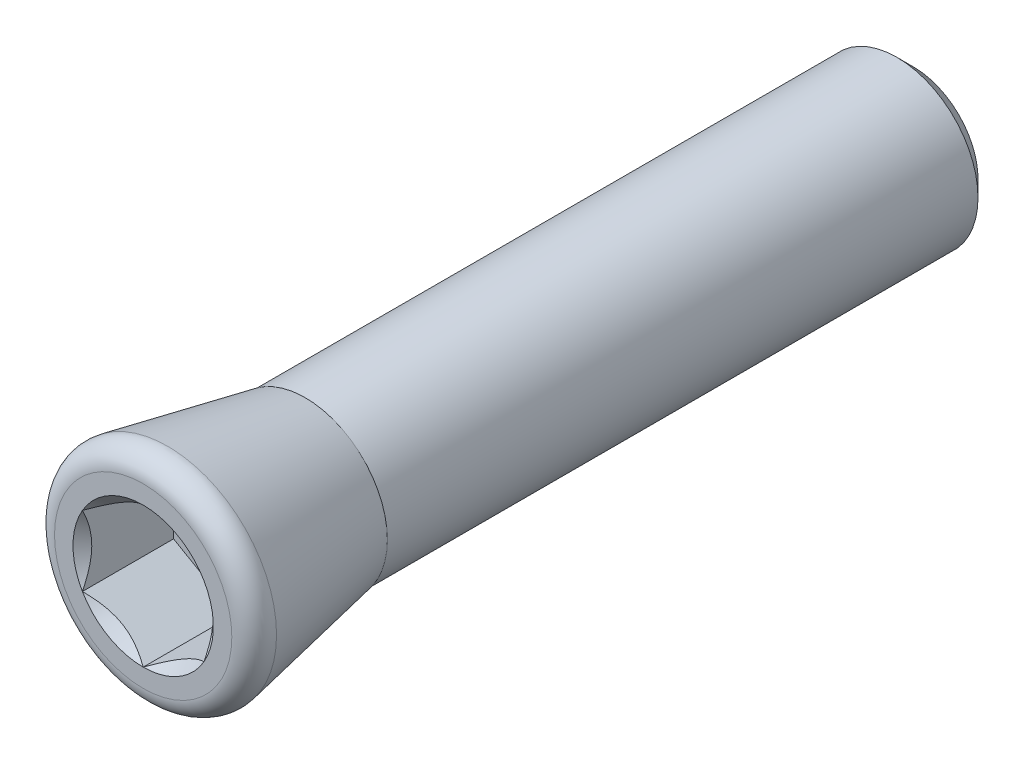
ISO-10303-21;
HEADER;
FILE_DESCRIPTION(('STEP AP214'),'2;1');
FILE_NAME('part.step','',(''),(''),'','','');
FILE_SCHEMA(('AUTOMOTIVE_DESIGN { 1 0 10303 214 1 1 1 1 }'));
ENDSEC;
DATA;
#1=APPLICATION_CONTEXT('core data for automotive mechanical design processes');
#2=APPLICATION_PROTOCOL_DEFINITION('international standard','automotive_design',2000,#1);
#3=PRODUCT_CONTEXT('',#1,'mechanical');
#4=PRODUCT('Part','Part','',(#3));
#5=PRODUCT_RELATED_PRODUCT_CATEGORY('part','',(#4));
#6=PRODUCT_DEFINITION_FORMATION('','',#4);
#7=PRODUCT_DEFINITION_CONTEXT('part definition',#1,'design');
#8=PRODUCT_DEFINITION('design','',#6,#7);
#9=PRODUCT_DEFINITION_SHAPE('','',#8);
#10=(LENGTH_UNIT() NAMED_UNIT(*) SI_UNIT(.MILLI.,.METRE.));
#11=(NAMED_UNIT(*) PLANE_ANGLE_UNIT() SI_UNIT($,.RADIAN.));
#12=(NAMED_UNIT(*) SI_UNIT($,.STERADIAN.) SOLID_ANGLE_UNIT());
#13=UNCERTAINTY_MEASURE_WITH_UNIT(LENGTH_MEASURE(1.E-05),#10,'distance_accuracy_value','');
#14=(GEOMETRIC_REPRESENTATION_CONTEXT(3) GLOBAL_UNCERTAINTY_ASSIGNED_CONTEXT((#13)) GLOBAL_UNIT_ASSIGNED_CONTEXT((#10,
#11,#12)) REPRESENTATION_CONTEXT('',''));
#15=CARTESIAN_POINT('',(0.,0.,0.));
#16=DIRECTION('',(0.,0.,1.));
#17=DIRECTION('',(1.,0.,0.));
#18=AXIS2_PLACEMENT_3D('',#15,#16,#17);
#19=CARTESIAN_POINT('',(0.,0.,0.));
#20=DIRECTION('',(0.,0.,1.));
#21=DIRECTION('',(1.,0.,0.));
#22=AXIS2_PLACEMENT_3D('',#19,#20,#21);
#23=PLANE('',#22);
#24=CARTESIAN_POINT('',(0.,0.,2.9549279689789E-11));
#25=DIRECTION('',(0.,0.,1.));
#26=DIRECTION('',(1.,0.,0.));
#27=AXIS2_PLACEMENT_3D('',#24,#25,#26);
#28=CIRCLE('',#27,4.0526140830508);
#29=CARTESIAN_POINT('',(4.0526140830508,0.,2.9549279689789E-11));
#30=VERTEX_POINT('',#29);
#31=EDGE_CURVE('E237',#30,#30,#28,.T.);
#32=ORIENTED_EDGE('',*,*,#31,.F.);
#33=EDGE_LOOP('',(#32));
#34=FACE_BOUND('',#33,.T.);
#35=CARTESIAN_POINT('',(0.,0.,0.));
#36=DIRECTION('',(0.,0.,1.));
#37=DIRECTION('',(1.,0.,0.));
#38=AXIS2_PLACEMENT_3D('',#35,#36,#37);
#39=CIRCLE('',#38,4.);
#40=CARTESIAN_POINT('',(4.,0.,0.));
#41=VERTEX_POINT('',#40);
#42=EDGE_CURVE('E314',#41,#41,#39,.F.);
#43=ORIENTED_EDGE('',*,*,#42,.F.);
#44=EDGE_LOOP('',(#43));
#45=FACE_BOUND('',#44,.T.);
#46=ADVANCED_FACE('F14',(#34,#45),#23,.F.);
#47=CARTESIAN_POINT('',(-3.,5.19615242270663,3.5));
#48=DIRECTION('',(0.,0.,1.));
#49=DIRECTION('',(1.,0.,0.));
#50=AXIS2_PLACEMENT_3D('',#47,#48,#49);
#51=PLANE('',#50);
#52=DIRECTION('',(-0.866025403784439,-0.5,0.));
#53=VECTOR('',#52,1.);
#54=CARTESIAN_POINT('',(0.,-3.46410161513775,3.5));
#55=LINE('',#54,#53);
#56=CARTESIAN_POINT('',(0.,-3.46410161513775,3.5));
#57=VERTEX_POINT('',#56);
#58=CARTESIAN_POINT('',(3.,-1.73205080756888,3.5));
#59=VERTEX_POINT('',#58);
#60=EDGE_CURVE('E284',#57,#59,#55,.F.);
#61=ORIENTED_EDGE('',*,*,#60,.T.);
#62=DIRECTION('',(0.,-1.,0.));
#63=VECTOR('',#62,1.);
#64=CARTESIAN_POINT('',(3.,-1.73205080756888,3.5));
#65=LINE('',#64,#63);
#66=CARTESIAN_POINT('',(3.,1.73205080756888,3.5));
#67=VERTEX_POINT('',#66);
#68=EDGE_CURVE('E288',#59,#67,#65,.F.);
#69=ORIENTED_EDGE('',*,*,#68,.T.);
#70=DIRECTION('',(0.866025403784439,-0.5,0.));
#71=VECTOR('',#70,1.);
#72=CARTESIAN_POINT('',(3.,1.73205080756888,3.5));
#73=LINE('',#72,#71);
#74=CARTESIAN_POINT('',(0.,3.46410161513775,3.5));
#75=VERTEX_POINT('',#74);
#76=EDGE_CURVE('E291',#67,#75,#73,.F.);
#77=ORIENTED_EDGE('',*,*,#76,.T.);
#78=DIRECTION('',(0.866025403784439,0.5,0.));
#79=VECTOR('',#78,1.);
#80=CARTESIAN_POINT('',(0.,3.46410161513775,3.5));
#81=LINE('',#80,#79);
#82=CARTESIAN_POINT('',(-3.,1.73205080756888,3.5));
#83=VERTEX_POINT('',#82);
#84=EDGE_CURVE('E82',#75,#83,#81,.F.);
#85=ORIENTED_EDGE('',*,*,#84,.T.);
#86=DIRECTION('',(0.,1.,0.));
#87=VECTOR('',#86,1.);
#88=CARTESIAN_POINT('',(-3.,1.73205080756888,3.5));
#89=LINE('',#88,#87);
#90=CARTESIAN_POINT('',(-3.,-1.73205080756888,3.5));
#91=VERTEX_POINT('',#90);
#92=EDGE_CURVE('E273',#83,#91,#89,.F.);
#93=ORIENTED_EDGE('',*,*,#92,.T.);
#94=DIRECTION('',(-0.866025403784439,0.5,0.));
#95=VECTOR('',#94,1.);
#96=CARTESIAN_POINT('',(-3.,-1.73205080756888,3.5));
#97=LINE('',#96,#95);
#98=EDGE_CURVE('E279',#91,#57,#97,.F.);
#99=ORIENTED_EDGE('',*,*,#98,.T.);
#100=EDGE_LOOP('',(#61,#69,#77,#85,#93,#99));
#101=FACE_BOUND('',#100,.T.);
#102=ADVANCED_FACE('F204',(#101),#51,.T.);
#103=CARTESIAN_POINT('',(3.,1.73205080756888,3.5));
#104=DIRECTION('',(0.5,0.866025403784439,0.));
#105=DIRECTION('',(0.866025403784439,-0.5,0.));
#106=AXIS2_PLACEMENT_3D('',#103,#104,#105);
#107=PLANE('',#106);
#108=CARTESIAN_POINT('',(2.99999999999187,1.73205080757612,8.00000000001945));
#109=CARTESIAN_POINT('',(2.8968885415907,1.79158223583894,7.94052569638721));
#110=CARTESIAN_POINT('',(2.79205304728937,1.85210903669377,7.88454499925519));
#111=CARTESIAN_POINT('',(2.57828271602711,1.9755293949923,7.78204673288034));
#112=CARTESIAN_POINT('',(2.46932756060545,2.03843468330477,7.73558617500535));
#113=CARTESIAN_POINT('',(2.24962485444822,2.16528009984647,7.65599891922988));
#114=CARTESIAN_POINT('',(2.13893322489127,2.22918794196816,7.62267223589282));
#115=CARTESIAN_POINT('',(1.91511368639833,2.35841021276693,7.57132616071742));
#116=CARTESIAN_POINT('',(1.80199261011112,2.42372069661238,7.55326845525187));
#117=CARTESIAN_POINT('',(1.60702348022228,2.53628617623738,7.53697523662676));
#118=CARTESIAN_POINT('',(1.52542705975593,2.58339589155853,7.53456399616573));
#119=CARTESIAN_POINT('',(1.36236704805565,2.67753863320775,7.53863151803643));
#120=CARTESIAN_POINT('',(1.28090351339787,2.72457162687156,7.54511339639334));
#121=CARTESIAN_POINT('',(1.11874833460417,2.8181919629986,7.5665970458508));
#122=CARTESIAN_POINT('',(1.03805765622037,2.86477874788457,7.58160834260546));
#123=CARTESIAN_POINT('',(0.878062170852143,2.95715218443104,7.6193315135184));
#124=CARTESIAN_POINT('',(0.798757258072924,3.00293889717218,7.64204279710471));
#125=CARTESIAN_POINT('',(0.657986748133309,3.08421278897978,7.6887637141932));
#126=CARTESIAN_POINT('',(0.59620919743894,3.11988007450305,7.71154386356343));
#127=CARTESIAN_POINT('',(0.47376285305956,3.19057450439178,7.76077453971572));
#128=CARTESIAN_POINT('',(0.413094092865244,3.22560162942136,7.78722517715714));
#129=CARTESIAN_POINT('',(0.293056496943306,3.29490536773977,7.84320408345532));
#130=CARTESIAN_POINT('',(0.233684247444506,3.3291839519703,7.87272267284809));
#131=CARTESIAN_POINT('',(0.116038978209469,3.39710647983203,7.93445005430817));
#132=CARTESIAN_POINT('',(0.0577653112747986,3.43075079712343,7.96665719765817));
#133=CARTESIAN_POINT('',(9.49404563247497E-12,3.46410161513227,8.0000000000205));
#134=B_SPLINE_CURVE_WITH_KNOTS('',3,(#108,#109,#110,#111,#112,#113,#114,#115,#116,#117,#118,
#119,#120,#121,#122,#123,#124,#125,#126,#127,#128,#129,#130,#131,#132,#133),.UNSPECIFIED.,.F.,
.F.,(4,2,2,2,2,2,2,2,2,2,2,2,4),(0.,0.399548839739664,0.801424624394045,1.19691998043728,
1.59141997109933,1.87377108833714,2.15622116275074,2.43898729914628,2.72173175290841,
2.94627735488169,3.17082972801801,3.39469398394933,3.61842195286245),.UNSPECIFIED.);
#135=CARTESIAN_POINT('',(2.99999999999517,1.73205080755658,8.0000000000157));
#136=VERTEX_POINT('',#135);
#137=CARTESIAN_POINT('',(0.,3.46410161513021,8.00000000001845));
#138=VERTEX_POINT('',#137);
#139=EDGE_CURVE('E86',#136,#138,#134,.T.);
#140=ORIENTED_EDGE('',*,*,#139,.T.);
#141=DIRECTION('',(0.,0.,-1.));
#142=VECTOR('',#141,1.);
#143=CARTESIAN_POINT('',(0.,3.46410161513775,3.5));
#144=LINE('',#143,#142);
#145=EDGE_CURVE('E75',#138,#75,#144,.T.);
#146=ORIENTED_EDGE('',*,*,#145,.T.);
#147=ORIENTED_EDGE('',*,*,#76,.F.);
#148=DIRECTION('',(0.,0.,-1.));
#149=VECTOR('',#148,1.);
#150=CARTESIAN_POINT('',(3.,1.73205080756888,3.5));
#151=LINE('',#150,#149);
#152=EDGE_CURVE('E99',#67,#136,#151,.F.);
#153=ORIENTED_EDGE('',*,*,#152,.T.);
#154=EDGE_LOOP('',(#140,#146,#147,#153));
#155=FACE_BOUND('',#154,.T.);
#156=ADVANCED_FACE('F98',(#155),#107,.F.);
#157=CARTESIAN_POINT('',(3.,-1.73205080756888,3.5));
#158=DIRECTION('',(1.,0.,0.));
#159=DIRECTION('',(0.,-1.,0.));
#160=AXIS2_PLACEMENT_3D('',#157,#158,#159);
#161=PLANE('',#160);
#162=CARTESIAN_POINT('',(3.0000000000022,-1.73205080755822,8.00000000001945));
#163=CARTESIAN_POINT('',(3.00000000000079,-1.61376575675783,7.94091264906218));
#164=CARTESIAN_POINT('',(3.00000000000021,-1.4935155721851,7.8852754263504));
#165=CARTESIAN_POINT('',(2.99999999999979,-1.24826765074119,7.78329127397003));
#166=CARTESIAN_POINT('',(2.99999999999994,-1.12324441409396,7.73700620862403));
#167=CARTESIAN_POINT('',(3.00000000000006,-0.869584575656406,7.65708182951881));
#168=CARTESIAN_POINT('',(3.00000000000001,-0.74096182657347,7.62339971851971));
#169=CARTESIAN_POINT('',(2.99999999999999,-0.480896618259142,7.57154472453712));
#170=CARTESIAN_POINT('',(3.,-0.349464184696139,7.55332388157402));
#171=CARTESIAN_POINT('',(3.,-0.181294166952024,7.54115187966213));
#172=CARTESIAN_POINT('',(3.,-0.145053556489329,7.53918403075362));
#173=CARTESIAN_POINT('',(3.,-0.0725435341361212,7.53655715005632));
#174=CARTESIAN_POINT('',(3.,-0.0362741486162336,7.53589740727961));
#175=CARTESIAN_POINT('',(3.,0.0910409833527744,7.53590083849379));
#176=CARTESIAN_POINT('',(3.,0.18211196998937,7.54006524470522));
#177=CARTESIAN_POINT('',(3.,0.363556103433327,7.55649323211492));
#178=CARTESIAN_POINT('',(3.,0.453928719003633,7.56876246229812));
#179=CARTESIAN_POINT('',(3.,0.633747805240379,7.60082407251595));
#180=CARTESIAN_POINT('',(3.,0.723188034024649,7.62065109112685));
#181=CARTESIAN_POINT('',(3.,0.900347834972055,7.66692147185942));
#182=CARTESIAN_POINT('',(3.,0.988066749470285,7.69336731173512));
#183=CARTESIAN_POINT('',(3.,1.18810094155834,7.76083336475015));
#184=CARTESIAN_POINT('',(3.,1.29974585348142,7.80383797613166));
#185=CARTESIAN_POINT('',(3.,1.46423831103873,7.87379605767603));
#186=CARTESIAN_POINT('',(3.,1.5183328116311,7.89790156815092));
#187=CARTESIAN_POINT('',(3.,1.62575498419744,7.94776323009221));
#188=CARTESIAN_POINT('',(3.,1.6790826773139,7.97351933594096));
#189=CARTESIAN_POINT('',(3.,1.73205080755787,8.0000000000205));
#190=B_SPLINE_CURVE_WITH_KNOTS('',3,(#162,#163,#164,#165,#166,#167,#168,#169,#170,#171,#172,
#173,#174,#175,#176,#177,#178,#179,#180,#181,#182,#183,#184,#185,#186,#187,#188,#189),
.UNSPECIFIED.,.F.,.F.,(4,2,2,2,2,2,2,2,2,2,2,2,2,4),(0.,0.396939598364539,0.79642467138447,
1.19454058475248,1.59141700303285,1.70028274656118,1.80908930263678,2.08217237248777,
2.35544597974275,2.62998740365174,2.90463175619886,3.26315842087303,3.44080555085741,
3.61844777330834),.UNSPECIFIED.);
#191=CARTESIAN_POINT('',(2.99999999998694,-1.73205080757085,8.0000000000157));
#192=VERTEX_POINT('',#191);
#193=EDGE_CURVE('E69',#192,#136,#190,.T.);
#194=ORIENTED_EDGE('',*,*,#193,.T.);
#195=ORIENTED_EDGE('',*,*,#152,.F.);
#196=ORIENTED_EDGE('',*,*,#68,.F.);
#197=DIRECTION('',(0.,0.,-1.));
#198=VECTOR('',#197,1.);
#199=CARTESIAN_POINT('',(3.,-1.73205080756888,3.5));
#200=LINE('',#199,#198);
#201=EDGE_CURVE('E282',#59,#192,#200,.F.);
#202=ORIENTED_EDGE('',*,*,#201,.T.);
#203=EDGE_LOOP('',(#194,#195,#196,#202));
#204=FACE_BOUND('',#203,.T.);
#205=ADVANCED_FACE('F178',(#204),#161,.F.);
#206=CARTESIAN_POINT('',(0.,-3.46410161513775,3.5));
#207=DIRECTION('',(0.5,-0.866025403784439,0.));
#208=DIRECTION('',(-0.866025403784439,-0.5,0.));
#209=AXIS2_PLACEMENT_3D('',#206,#207,#208);
#210=PLANE('',#209);
#211=CARTESIAN_POINT('',(1.0332404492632E-11,-3.46410161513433,8.00000000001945));
#212=CARTESIAN_POINT('',(0.10311145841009,-3.40457018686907,7.94052569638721));
#213=CARTESIAN_POINT('',(0.207946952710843,-3.34404338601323,7.88454499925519));
#214=CARTESIAN_POINT('',(0.421717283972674,-3.22062302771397,7.78204673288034));
#215=CARTESIAN_POINT('',(0.530672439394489,-3.15771773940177,7.73558617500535));
#216=CARTESIAN_POINT('',(0.750375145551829,-3.03087232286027,7.65599891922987));
#217=CARTESIAN_POINT('',(0.861066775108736,-2.9669644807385,7.62267223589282));
#218=CARTESIAN_POINT('',(1.08488631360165,-2.83774220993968,7.57132616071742));
#219=CARTESIAN_POINT('',(1.19800738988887,-2.77243172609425,7.55326845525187));
#220=CARTESIAN_POINT('',(1.39297651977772,-2.65986624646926,7.53697523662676));
#221=CARTESIAN_POINT('',(1.47457294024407,-2.6127565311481,7.53456399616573));
#222=CARTESIAN_POINT('',(1.63763295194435,-2.51861378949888,7.53863151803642));
#223=CARTESIAN_POINT('',(1.71909648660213,-2.47158079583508,7.54511339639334));
#224=CARTESIAN_POINT('',(1.88125166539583,-2.37796045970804,7.5665970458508));
#225=CARTESIAN_POINT('',(1.96194234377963,-2.33137367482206,7.58160834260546));
#226=CARTESIAN_POINT('',(2.12193782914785,-2.23900023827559,7.6193315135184));
#227=CARTESIAN_POINT('',(2.20124274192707,-2.19321352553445,7.64204279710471));
#228=CARTESIAN_POINT('',(2.34201325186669,-2.11193963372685,7.6887637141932));
#229=CARTESIAN_POINT('',(2.40379080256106,-2.07627234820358,7.71154386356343));
#230=CARTESIAN_POINT('',(2.52623714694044,-2.00557791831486,7.76077453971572));
#231=CARTESIAN_POINT('',(2.58690590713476,-1.97055079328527,7.78722517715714));
#232=CARTESIAN_POINT('',(2.70694350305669,-1.90124705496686,7.84320408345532));
#233=CARTESIAN_POINT('',(2.76631575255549,-1.86696847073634,7.87272267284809));
#234=CARTESIAN_POINT('',(2.88396102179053,-1.7990459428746,7.93445005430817));
#235=CARTESIAN_POINT('',(2.9422346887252,-1.76540162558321,7.96665719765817));
#236=CARTESIAN_POINT('',(2.9999999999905,-1.73205080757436,8.0000000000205));
#237=B_SPLINE_CURVE_WITH_KNOTS('',3,(#211,#212,#213,#214,#215,#216,#217,#218,#219,#220,#221,
#222,#223,#224,#225,#226,#227,#228,#229,#230,#231,#232,#233,#234,#235,#236),.UNSPECIFIED.,.F.,
.F.,(4,2,2,2,2,2,2,2,2,2,2,2,4),(0.,0.399548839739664,0.801424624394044,1.19691998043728,
1.59141997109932,1.87377108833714,2.15622116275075,2.43898729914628,2.72173175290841,
2.94627735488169,3.17082972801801,3.39469398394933,3.61842195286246),.UNSPECIFIED.);
#238=CARTESIAN_POINT('',(-8.2386043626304E-12,-3.46410161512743,8.0000000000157));
#239=VERTEX_POINT('',#238);
#240=EDGE_CURVE('E161',#239,#192,#237,.T.);
#241=ORIENTED_EDGE('',*,*,#240,.T.);
#242=ORIENTED_EDGE('',*,*,#201,.F.);
#243=ORIENTED_EDGE('',*,*,#60,.F.);
#244=DIRECTION('',(0.,0.,-1.));
#245=VECTOR('',#244,1.);
#246=CARTESIAN_POINT('',(0.,-3.46410161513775,3.5));
#247=LINE('',#246,#245);
#248=EDGE_CURVE('E276',#57,#239,#247,.F.);
#249=ORIENTED_EDGE('',*,*,#248,.T.);
#250=EDGE_LOOP('',(#241,#242,#243,#249));
#251=FACE_BOUND('',#250,.T.);
#252=ADVANCED_FACE('F172',(#251),#210,.F.);
#253=CARTESIAN_POINT('',(-3.,-1.73205080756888,3.5));
#254=DIRECTION('',(-0.5,-0.866025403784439,0.));
#255=DIRECTION('',(-0.866025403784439,0.5,0.));
#256=AXIS2_PLACEMENT_3D('',#253,#254,#255);
#257=PLANE('',#256);
#258=CARTESIAN_POINT('',(-2.99999999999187,-1.73205080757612,8.00000000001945));
#259=CARTESIAN_POINT('',(-2.8968885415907,-1.79158223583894,7.94052569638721));
#260=CARTESIAN_POINT('',(-2.79205304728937,-1.85210903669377,7.8845449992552));
#261=CARTESIAN_POINT('',(-2.57828271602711,-1.9755293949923,7.78204673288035));
#262=CARTESIAN_POINT('',(-2.46932756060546,-2.03843468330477,7.73558617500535));
#263=CARTESIAN_POINT('',(-2.24962485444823,-2.16528009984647,7.65599891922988));
#264=CARTESIAN_POINT('',(-2.13893322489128,-2.22918794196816,7.62267223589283));
#265=CARTESIAN_POINT('',(-1.91511368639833,-2.35841021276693,7.57132616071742));
#266=CARTESIAN_POINT('',(-1.80199261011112,-2.42372069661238,7.55326845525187));
#267=CARTESIAN_POINT('',(-1.60702348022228,-2.53628617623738,7.53697523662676));
#268=CARTESIAN_POINT('',(-1.52542705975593,-2.58339589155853,7.53456399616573));
#269=CARTESIAN_POINT('',(-1.36236704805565,-2.67753863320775,7.53863151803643));
#270=CARTESIAN_POINT('',(-1.28090351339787,-2.72457162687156,7.54511339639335));
#271=CARTESIAN_POINT('',(-1.11874833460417,-2.81819196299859,7.5665970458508));
#272=CARTESIAN_POINT('',(-1.03805765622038,-2.86477874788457,7.58160834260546));
#273=CARTESIAN_POINT('',(-0.878062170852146,-2.95715218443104,7.6193315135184));
#274=CARTESIAN_POINT('',(-0.798757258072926,-3.00293889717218,7.64204279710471));
#275=CARTESIAN_POINT('',(-0.657986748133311,-3.08421278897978,7.6887637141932));
#276=CARTESIAN_POINT('',(-0.596209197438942,-3.11988007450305,7.71154386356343));
#277=CARTESIAN_POINT('',(-0.473762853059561,-3.19057450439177,7.76077453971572));
#278=CARTESIAN_POINT('',(-0.413094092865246,-3.22560162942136,7.78722517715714));
#279=CARTESIAN_POINT('',(-0.293056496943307,-3.29490536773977,7.84320408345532));
#280=CARTESIAN_POINT('',(-0.233684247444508,-3.3291839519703,7.87272267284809));
#281=CARTESIAN_POINT('',(-0.116038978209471,-3.39710647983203,7.93445005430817));
#282=CARTESIAN_POINT('',(-0.0577653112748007,-3.43075079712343,7.96665719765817));
#283=CARTESIAN_POINT('',(-9.49713373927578E-12,-3.46410161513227,8.0000000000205));
#284=B_SPLINE_CURVE_WITH_KNOTS('',3,(#258,#259,#260,#261,#262,#263,#264,#265,#266,#267,#268,
#269,#270,#271,#272,#273,#274,#275,#276,#277,#278,#279,#280,#281,#282,#283),.UNSPECIFIED.,.F.,
.F.,(4,2,2,2,2,2,2,2,2,2,2,2,4),(0.,0.399548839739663,0.801424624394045,1.19691998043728,
1.59141997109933,1.87377108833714,2.15622116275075,2.43898729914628,2.72173175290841,
2.94627735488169,3.17082972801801,3.39469398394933,3.61842195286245),.UNSPECIFIED.);
#285=CARTESIAN_POINT('',(-2.99999999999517,-1.73205080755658,8.0000000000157));
#286=VERTEX_POINT('',#285);
#287=EDGE_CURVE('E153',#286,#239,#284,.T.);
#288=ORIENTED_EDGE('',*,*,#287,.T.);
#289=ORIENTED_EDGE('',*,*,#248,.F.);
#290=ORIENTED_EDGE('',*,*,#98,.F.);
#291=DIRECTION('',(0.,0.,1.));
#292=VECTOR('',#291,1.);
#293=CARTESIAN_POINT('',(-3.,-1.73205080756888,3.5));
#294=LINE('',#293,#292);
#295=EDGE_CURVE('E270',#91,#286,#294,.T.);
#296=ORIENTED_EDGE('',*,*,#295,.T.);
#297=EDGE_LOOP('',(#288,#289,#290,#296));
#298=FACE_BOUND('',#297,.T.);
#299=ADVANCED_FACE('F168',(#298),#257,.F.);
#300=CARTESIAN_POINT('',(-3.,1.73205080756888,3.5));
#301=DIRECTION('',(-1.,0.,0.));
#302=DIRECTION('',(0.,0.,1.));
#303=AXIS2_PLACEMENT_3D('',#300,#301,#302);
#304=PLANE('',#303);
#305=CARTESIAN_POINT('',(-3.0000000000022,1.73205080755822,8.00000000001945));
#306=CARTESIAN_POINT('',(-3.00000000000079,1.61298795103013,7.94052569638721));
#307=CARTESIAN_POINT('',(-3.00000000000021,1.49193434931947,7.88454499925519));
#308=CARTESIAN_POINT('',(-2.99999999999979,1.24509363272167,7.78204673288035));
#309=CARTESIAN_POINT('',(-2.99999999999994,1.119283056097,7.73558617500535));
#310=CARTESIAN_POINT('',(-3.00000000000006,0.865592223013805,7.65599891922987));
#311=CARTESIAN_POINT('',(-3.00000000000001,0.737776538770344,7.62267223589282));
#312=CARTESIAN_POINT('',(-2.99999999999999,0.479331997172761,7.57132616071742));
#313=CARTESIAN_POINT('',(-3.,0.348711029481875,7.55326845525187));
#314=CARTESIAN_POINT('',(-3.,0.123580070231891,7.53697523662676));
#315=CARTESIAN_POINT('',(-3.,0.0293606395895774,7.53456399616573));
#316=CARTESIAN_POINT('',(-3.,-0.158924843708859,7.53863151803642));
#317=CARTESIAN_POINT('',(-3.,-0.252990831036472,7.54511339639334));
#318=CARTESIAN_POINT('',(-3.,-0.440231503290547,7.5665970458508));
#319=CARTESIAN_POINT('',(-3.,-0.533405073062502,7.58160834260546));
#320=CARTESIAN_POINT('',(-3.,-0.718151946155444,7.6193315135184));
#321=CARTESIAN_POINT('',(-3.,-0.809725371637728,7.64204279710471));
#322=CARTESIAN_POINT('',(-3.,-0.972273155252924,7.6887637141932));
#323=CARTESIAN_POINT('',(-3.,-1.04360772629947,7.71154386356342));
#324=CARTESIAN_POINT('',(-3.,-1.18499658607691,7.76077453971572));
#325=CARTESIAN_POINT('',(-3.,-1.25505083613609,7.78722517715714));
#326=CARTESIAN_POINT('',(-3.,-1.3936583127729,7.84320408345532));
#327=CARTESIAN_POINT('',(-3.,-1.46221548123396,7.87272267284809));
#328=CARTESIAN_POINT('',(-3.,-1.59806053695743,7.93445005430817));
#329=CARTESIAN_POINT('',(-3.,-1.66534917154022,7.96665719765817));
#330=CARTESIAN_POINT('',(-3.,-1.73205080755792,8.0000000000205));
#331=B_SPLINE_CURVE_WITH_KNOTS('',3,(#305,#306,#307,#308,#309,#310,#311,#312,#313,#314,#315,
#316,#317,#318,#319,#320,#321,#322,#323,#324,#325,#326,#327,#328,#329,#330),.UNSPECIFIED.,.F.,
.F.,(4,2,2,2,2,2,2,2,2,2,2,2,4),(0.,0.399548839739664,0.801424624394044,1.19691998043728,
1.59141997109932,1.87377108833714,2.15622116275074,2.43898729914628,2.7217317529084,
2.94627735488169,3.17082972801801,3.39469398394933,3.61842195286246),.UNSPECIFIED.);
#332=CARTESIAN_POINT('',(-2.99999999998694,1.73205080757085,8.0000000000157));
#333=VERTEX_POINT('',#332);
#334=EDGE_CURVE('E94',#333,#286,#331,.T.);
#335=ORIENTED_EDGE('',*,*,#334,.T.);
#336=ORIENTED_EDGE('',*,*,#295,.F.);
#337=ORIENTED_EDGE('',*,*,#92,.F.);
#338=DIRECTION('',(0.,0.,-1.));
#339=VECTOR('',#338,1.);
#340=CARTESIAN_POINT('',(-3.,1.73205080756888,3.5));
#341=LINE('',#340,#339);
#342=EDGE_CURVE('E87',#83,#333,#341,.F.);
#343=ORIENTED_EDGE('',*,*,#342,.T.);
#344=EDGE_LOOP('',(#335,#336,#337,#343));
#345=FACE_BOUND('',#344,.T.);
#346=ADVANCED_FACE('F171',(#345),#304,.F.);
#347=CARTESIAN_POINT('',(0.,3.46410161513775,3.5));
#348=DIRECTION('',(-0.5,0.866025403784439,0.));
#349=DIRECTION('',(0.866025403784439,0.5,0.));
#350=AXIS2_PLACEMENT_3D('',#347,#348,#349);
#351=PLANE('',#350);
#352=CARTESIAN_POINT('',(-1.03344161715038E-11,3.46410161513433,8.00000000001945));
#353=CARTESIAN_POINT('',(-0.103111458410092,3.40457018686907,7.94052569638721));
#354=CARTESIAN_POINT('',(-0.207946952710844,3.34404338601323,7.88454499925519));
#355=CARTESIAN_POINT('',(-0.421717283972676,3.22062302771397,7.78204673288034));
#356=CARTESIAN_POINT('',(-0.53067243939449,3.15771773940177,7.73558617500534));
#357=CARTESIAN_POINT('',(-0.75037514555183,3.03087232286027,7.65599891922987));
#358=CARTESIAN_POINT('',(-0.861066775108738,2.9669644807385,7.62267223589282));
#359=CARTESIAN_POINT('',(-1.08488631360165,2.83774220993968,7.57132616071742));
#360=CARTESIAN_POINT('',(-1.19800738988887,2.77243172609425,7.55326845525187));
#361=CARTESIAN_POINT('',(-1.39297651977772,2.65986624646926,7.53697523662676));
#362=CARTESIAN_POINT('',(-1.47457294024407,2.6127565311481,7.53456399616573));
#363=CARTESIAN_POINT('',(-1.63763295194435,2.51861378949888,7.53863151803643));
#364=CARTESIAN_POINT('',(-1.71909648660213,2.47158079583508,7.54511339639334));
#365=CARTESIAN_POINT('',(-1.88125166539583,2.37796045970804,7.5665970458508));
#366=CARTESIAN_POINT('',(-1.96194234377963,2.33137367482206,7.58160834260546));
#367=CARTESIAN_POINT('',(-2.12193782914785,2.23900023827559,7.6193315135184));
#368=CARTESIAN_POINT('',(-2.20124274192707,2.19321352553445,7.64204279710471));
#369=CARTESIAN_POINT('',(-2.34201325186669,2.11193963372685,7.6887637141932));
#370=CARTESIAN_POINT('',(-2.40379080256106,2.07627234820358,7.71154386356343));
#371=CARTESIAN_POINT('',(-2.52623714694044,2.00557791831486,7.76077453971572));
#372=CARTESIAN_POINT('',(-2.58690590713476,1.97055079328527,7.78722517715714));
#373=CARTESIAN_POINT('',(-2.7069435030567,1.90124705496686,7.84320408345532));
#374=CARTESIAN_POINT('',(-2.76631575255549,1.86696847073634,7.87272267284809));
#375=CARTESIAN_POINT('',(-2.88396102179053,1.7990459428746,7.93445005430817));
#376=CARTESIAN_POINT('',(-2.9422346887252,1.76540162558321,7.96665719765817));
#377=CARTESIAN_POINT('',(-2.9999999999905,1.73205080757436,8.0000000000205));
#378=B_SPLINE_CURVE_WITH_KNOTS('',3,(#352,#353,#354,#355,#356,#357,#358,#359,#360,#361,#362,
#363,#364,#365,#366,#367,#368,#369,#370,#371,#372,#373,#374,#375,#376,#377),.UNSPECIFIED.,.F.,
.F.,(4,2,2,2,2,2,2,2,2,2,2,2,4),(0.,0.399548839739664,0.801424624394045,1.19691998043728,
1.59141997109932,1.87377108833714,2.15622116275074,2.43898729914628,2.72173175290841,
2.94627735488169,3.17082972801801,3.39469398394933,3.61842195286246),.UNSPECIFIED.);
#379=EDGE_CURVE('E79',#138,#333,#378,.T.);
#380=ORIENTED_EDGE('',*,*,#379,.T.);
#381=ORIENTED_EDGE('',*,*,#342,.F.);
#382=ORIENTED_EDGE('',*,*,#84,.F.);
#383=ORIENTED_EDGE('',*,*,#145,.F.);
#384=EDGE_LOOP('',(#380,#381,#382,#383));
#385=FACE_BOUND('',#384,.T.);
#386=ADVANCED_FACE('F77',(#385),#351,.F.);
#387=CARTESIAN_POINT('',(0.,0.,8.0000000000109));
#388=DIRECTION('',(0.,0.,1.));
#389=DIRECTION('',(1.,0.,0.));
#390=AXIS2_PLACEMENT_3D('',#387,#388,#389);
#391=CONICAL_SURFACE('',#390,3.46410161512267,0.785398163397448);
#392=ORIENTED_EDGE('',*,*,#139,.F.);
#393=CARTESIAN_POINT('',(0.,0.,8.0000000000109));
#394=DIRECTION('',(0.,0.,1.));
#395=DIRECTION('',(1.,0.,0.));
#396=AXIS2_PLACEMENT_3D('',#393,#394,#395);
#397=CIRCLE('',#396,3.46410161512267);
#398=EDGE_CURVE('E93',#138,#136,#397,.F.);
#399=ORIENTED_EDGE('',*,*,#398,.F.);
#400=EDGE_LOOP('',(#392,#399));
#401=FACE_BOUND('',#400,.T.);
#402=ADVANCED_FACE('F113',(#401),#391,.F.);
#403=CARTESIAN_POINT('',(0.,0.,8.0000000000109));
#404=DIRECTION('',(0.,0.,1.));
#405=DIRECTION('',(1.,0.,0.));
#406=AXIS2_PLACEMENT_3D('',#403,#404,#405);
#407=CONICAL_SURFACE('',#406,3.46410161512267,0.785398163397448);
#408=ORIENTED_EDGE('',*,*,#193,.F.);
#409=CARTESIAN_POINT('',(0.,0.,8.0000000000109));
#410=DIRECTION('',(0.,0.,1.));
#411=DIRECTION('',(1.,0.,0.));
#412=AXIS2_PLACEMENT_3D('',#409,#410,#411);
#413=CIRCLE('',#412,3.46410161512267);
#414=EDGE_CURVE('E114',#136,#192,#413,.F.);
#415=ORIENTED_EDGE('',*,*,#414,.F.);
#416=EDGE_LOOP('',(#408,#415));
#417=FACE_BOUND('',#416,.T.);
#418=ADVANCED_FACE('F193',(#417),#407,.F.);
#419=CARTESIAN_POINT('',(0.,0.,8.0000000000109));
#420=DIRECTION('',(0.,0.,1.));
#421=DIRECTION('',(1.,0.,0.));
#422=AXIS2_PLACEMENT_3D('',#419,#420,#421);
#423=CONICAL_SURFACE('',#422,3.46410161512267,0.785398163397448);
#424=ORIENTED_EDGE('',*,*,#240,.F.);
#425=CARTESIAN_POINT('',(0.,0.,8.0000000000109));
#426=DIRECTION('',(0.,0.,1.));
#427=DIRECTION('',(1.,0.,0.));
#428=AXIS2_PLACEMENT_3D('',#425,#426,#427);
#429=CIRCLE('',#428,3.46410161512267);
#430=EDGE_CURVE('E116',#192,#239,#429,.F.);
#431=ORIENTED_EDGE('',*,*,#430,.F.);
#432=EDGE_LOOP('',(#424,#431));
#433=FACE_BOUND('',#432,.T.);
#434=ADVANCED_FACE('F149',(#433),#423,.F.);
#435=CARTESIAN_POINT('',(0.,0.,8.0000000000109));
#436=DIRECTION('',(0.,0.,1.));
#437=DIRECTION('',(1.,0.,0.));
#438=AXIS2_PLACEMENT_3D('',#435,#436,#437);
#439=CONICAL_SURFACE('',#438,3.46410161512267,0.785398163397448);
#440=ORIENTED_EDGE('',*,*,#287,.F.);
#441=CARTESIAN_POINT('',(0.,0.,8.0000000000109));
#442=DIRECTION('',(0.,0.,1.));
#443=DIRECTION('',(1.,0.,0.));
#444=AXIS2_PLACEMENT_3D('',#441,#442,#443);
#445=CIRCLE('',#444,3.46410161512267);
#446=EDGE_CURVE('E317',#239,#286,#445,.F.);
#447=ORIENTED_EDGE('',*,*,#446,.F.);
#448=EDGE_LOOP('',(#440,#447));
#449=FACE_BOUND('',#448,.T.);
#450=ADVANCED_FACE('F144',(#449),#439,.F.);
#451=CARTESIAN_POINT('',(0.,0.,8.0000000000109));
#452=DIRECTION('',(0.,0.,1.));
#453=DIRECTION('',(1.,0.,0.));
#454=AXIS2_PLACEMENT_3D('',#451,#452,#453);
#455=CONICAL_SURFACE('',#454,3.46410161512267,0.785398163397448);
#456=ORIENTED_EDGE('',*,*,#334,.F.);
#457=CARTESIAN_POINT('',(0.,0.,8.0000000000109));
#458=DIRECTION('',(0.,0.,1.));
#459=DIRECTION('',(1.,0.,0.));
#460=AXIS2_PLACEMENT_3D('',#457,#458,#459);
#461=CIRCLE('',#460,3.46410161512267);
#462=EDGE_CURVE('E110',#286,#333,#461,.F.);
#463=ORIENTED_EDGE('',*,*,#462,.F.);
#464=EDGE_LOOP('',(#456,#463));
#465=FACE_BOUND('',#464,.T.);
#466=ADVANCED_FACE('F138',(#465),#455,.F.);
#467=CARTESIAN_POINT('',(0.,0.,8.0000000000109));
#468=DIRECTION('',(0.,0.,1.));
#469=DIRECTION('',(1.,0.,0.));
#470=AXIS2_PLACEMENT_3D('',#467,#468,#469);
#471=CONICAL_SURFACE('',#470,3.46410161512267,0.785398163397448);
#472=ORIENTED_EDGE('',*,*,#379,.F.);
#473=CARTESIAN_POINT('',(0.,0.,8.0000000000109));
#474=DIRECTION('',(0.,0.,1.));
#475=DIRECTION('',(1.,0.,0.));
#476=AXIS2_PLACEMENT_3D('',#473,#474,#475);
#477=CIRCLE('',#476,3.46410161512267);
#478=EDGE_CURVE('E92',#333,#138,#477,.F.);
#479=ORIENTED_EDGE('',*,*,#478,.F.);
#480=EDGE_LOOP('',(#472,#479));
#481=FACE_BOUND('',#480,.T.);
#482=ADVANCED_FACE('F90',(#481),#471,.F.);
#483=CARTESIAN_POINT('',(0.,0.,8.));
#484=DIRECTION('',(0.,0.,1.));
#485=DIRECTION('',(1.,0.,0.));
#486=AXIS2_PLACEMENT_3D('',#483,#484,#485);
#487=PLANE('',#486);
#488=CARTESIAN_POINT('',(0.,0.,8.));
#489=DIRECTION('',(0.,0.,-1.));
#490=DIRECTION('',(-1.,0.,0.));
#491=AXIS2_PLACEMENT_3D('',#488,#489,#490);
#492=CIRCLE('',#491,4.37515);
#493=CARTESIAN_POINT('',(-4.37515,0.,8.));
#494=VERTEX_POINT('',#493);
#495=CARTESIAN_POINT('',(4.37515,0.,8.));
#496=VERTEX_POINT('',#495);
#497=EDGE_CURVE('E111',#494,#496,#492,.T.);
#498=ORIENTED_EDGE('',*,*,#497,.F.);
#499=CARTESIAN_POINT('',(0.,0.,8.));
#500=DIRECTION('',(0.,0.,-1.));
#501=DIRECTION('',(1.,0.,0.));
#502=AXIS2_PLACEMENT_3D('',#499,#500,#501);
#503=CIRCLE('',#502,4.37515);
#504=EDGE_CURVE('E30',#496,#494,#503,.T.);
#505=ORIENTED_EDGE('',*,*,#504,.F.);
#506=EDGE_LOOP('',(#498,#505));
#507=FACE_BOUND('',#506,.T.);
#508=ORIENTED_EDGE('',*,*,#462,.T.);
#509=ORIENTED_EDGE('',*,*,#478,.T.);
#510=ORIENTED_EDGE('',*,*,#398,.T.);
#511=ORIENTED_EDGE('',*,*,#414,.T.);
#512=ORIENTED_EDGE('',*,*,#430,.T.);
#513=ORIENTED_EDGE('',*,*,#446,.T.);
#514=EDGE_LOOP('',(#508,#509,#510,#511,#512,#513));
#515=FACE_BOUND('',#514,.T.);
#516=ADVANCED_FACE('F106',(#507,#515),#487,.T.);
#517=CARTESIAN_POINT('',(0.,0.,6.984));
#518=DIRECTION('',(0.,0.,-1.));
#519=DIRECTION('',(-1.,0.,0.));
#520=AXIS2_PLACEMENT_3D('',#517,#518,#519);
#521=TOROIDAL_SURFACE('',#520,4.37515,1.016);
#522=ORIENTED_EDGE('',*,*,#497,.T.);
#523=ORIENTED_EDGE('',*,*,#504,.T.);
#524=EDGE_LOOP('',(#522,#523));
#525=FACE_BOUND('',#524,.T.);
#526=CARTESIAN_POINT('',(0.,0.,6.7901380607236));
#527=DIRECTION('',(0.,0.,1.));
#528=DIRECTION('',(1.,0.,0.));
#529=AXIS2_PLACEMENT_3D('',#526,#527,#528);
#530=CIRCLE('',#529,5.37248321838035);
#531=CARTESIAN_POINT('',(5.37248321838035,0.,6.7901380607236));
#532=VERTEX_POINT('',#531);
#533=EDGE_CURVE('E234',#532,#532,#530,.F.);
#534=ORIENTED_EDGE('',*,*,#533,.F.);
#535=EDGE_LOOP('',(#534));
#536=FACE_BOUND('',#535,.T.);
#537=ADVANCED_FACE('F218',(#525,#536),#521,.T.);
#538=CARTESIAN_POINT('',(0.,0.,6.7901380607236));
#539=DIRECTION('',(0.,0.,1.));
#540=DIRECTION('',(1.,0.,0.));
#541=AXIS2_PLACEMENT_3D('',#538,#539,#540);
#542=CONICAL_SURFACE('',#541,5.37248321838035,0.191986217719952);
#543=ORIENTED_EDGE('',*,*,#31,.T.);
#544=EDGE_LOOP('',(#543));
#545=FACE_BOUND('',#544,.T.);
#546=ORIENTED_EDGE('',*,*,#533,.T.);
#547=EDGE_LOOP('',(#546));
#548=FACE_BOUND('',#547,.T.);
#549=ADVANCED_FACE('F207',(#545,#548),#542,.T.);
#550=CARTESIAN_POINT('',(0.,0.,-30.));
#551=DIRECTION('',(0.,0.,1.));
#552=DIRECTION('',(1.,0.,0.));
#553=AXIS2_PLACEMENT_3D('',#550,#551,#552);
#554=CYLINDRICAL_SURFACE('',#553,4.);
#555=CARTESIAN_POINT('',(0.,0.,-29.2));
#556=DIRECTION('',(0.,0.,-1.));
#557=DIRECTION('',(-1.,0.,0.));
#558=AXIS2_PLACEMENT_3D('',#555,#556,#557);
#559=CIRCLE('',#558,4.);
#560=CARTESIAN_POINT('',(-4.,0.,-29.2));
#561=VERTEX_POINT('',#560);
#562=EDGE_CURVE('E9',#561,#561,#559,.F.);
#563=ORIENTED_EDGE('',*,*,#562,.T.);
#564=EDGE_LOOP('',(#563));
#565=FACE_BOUND('',#564,.T.);
#566=ORIENTED_EDGE('',*,*,#42,.T.);
#567=EDGE_LOOP('',(#566));
#568=FACE_BOUND('',#567,.T.);
#569=ADVANCED_FACE('F212',(#565,#568),#554,.T.);
#570=CARTESIAN_POINT('',(0.,0.,-30.));
#571=DIRECTION('',(0.,0.,-1.));
#572=DIRECTION('',(-1.,0.,0.));
#573=AXIS2_PLACEMENT_3D('',#570,#571,#572);
#574=PLANE('',#573);
#575=CARTESIAN_POINT('',(0.,0.,-30.));
#576=DIRECTION('',(0.,0.,-1.));
#577=DIRECTION('',(-1.,0.,0.));
#578=AXIS2_PLACEMENT_3D('',#575,#576,#577);
#579=CIRCLE('',#578,3.2);
#580=CARTESIAN_POINT('',(-3.2,0.,-30.));
#581=VERTEX_POINT('',#580);
#582=EDGE_CURVE('E23',#581,#581,#579,.T.);
#583=ORIENTED_EDGE('',*,*,#582,.T.);
#584=EDGE_LOOP('',(#583));
#585=FACE_BOUND('',#584,.T.);
#586=ADVANCED_FACE('F224',(#585),#574,.T.);
#587=CARTESIAN_POINT('',(0.,0.,-30.));
#588=DIRECTION('',(0.,0.,1.));
#589=DIRECTION('',(1.,0.,0.));
#590=AXIS2_PLACEMENT_3D('',#587,#588,#589);
#591=CONICAL_SURFACE('',#590,3.2,0.785398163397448);
#592=ORIENTED_EDGE('',*,*,#562,.F.);
#593=EDGE_LOOP('',(#592));
#594=FACE_BOUND('',#593,.T.);
#595=ORIENTED_EDGE('',*,*,#582,.F.);
#596=EDGE_LOOP('',(#595));
#597=FACE_BOUND('',#596,.T.);
#598=ADVANCED_FACE('F16',(#594,#597),#591,.T.);
#599=CLOSED_SHELL('',(#46,#102,#156,#205,#252,#299,#346,#386,#402,#418,#434,#450,#466,#482,#516,
#537,#549,#569,#586,#598));
#600=MANIFOLD_SOLID_BREP('B1',#599);
#601=ADVANCED_BREP_SHAPE_REPRESENTATION('',(#18,#600),#14);
#602=SHAPE_DEFINITION_REPRESENTATION(#9,#601);
ENDSEC;
END-ISO-10303-21;
